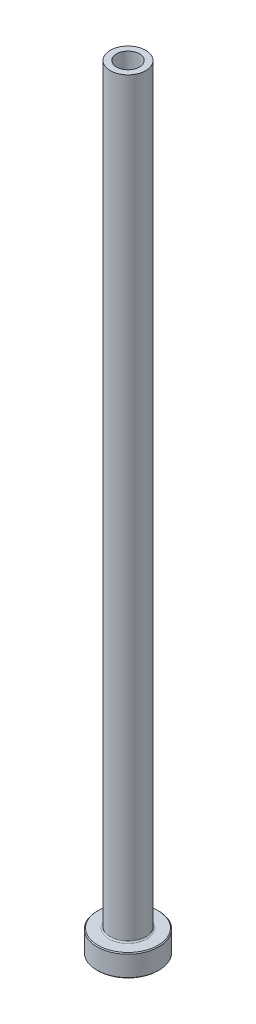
from build123d import *

# Parameters (mm, degrees)
FILLET1_R     = 0.3
CHAMFER1_SIZE = 0.2
CHAMFER3_SIZE = 0.5


with BuildPart() as part:
    # Sketch1 → Revolve1 (revolve)
    with BuildSketch(Plane.XY, mode=Mode.PRIVATE) as revolve1_sk:
        Polygon((-2.6, 175), (-4, 175), (-4, 5), (-7, 5), (-7, 0), (-2.85, 0), (-2.85, 118), (-2.6, 130), align=None)
    revolve(revolve1_sk.sketch.rotate(Axis((0, 92.187680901, 0), (0, -1, 0)), 270), axis=Axis((0, 92.187680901, 0), (0, -1, 0)))

    # Fillet1
    fillet1_edges = [part.edges().sort_by_distance(p)[0] for p in [
        (0, 5, -4),
    ]]
    fillet(fillet1_edges, radius=FILLET1_R)

    # Chamfer1
    chamfer1_edges = [part.edges().sort_by_distance(p)[0] for p in [
        (0, 0, -7),
        (0, 5, -7),
    ]]
    chamfer(chamfer1_edges, length=CHAMFER1_SIZE)

    # Chamfer3
    chamfer3_edges = [part.edges().sort_by_distance(p)[0] for p in [
        (0, 0, -2.85),
    ]]
    chamfer(chamfer3_edges, length=CHAMFER3_SIZE)


solid = part.part
